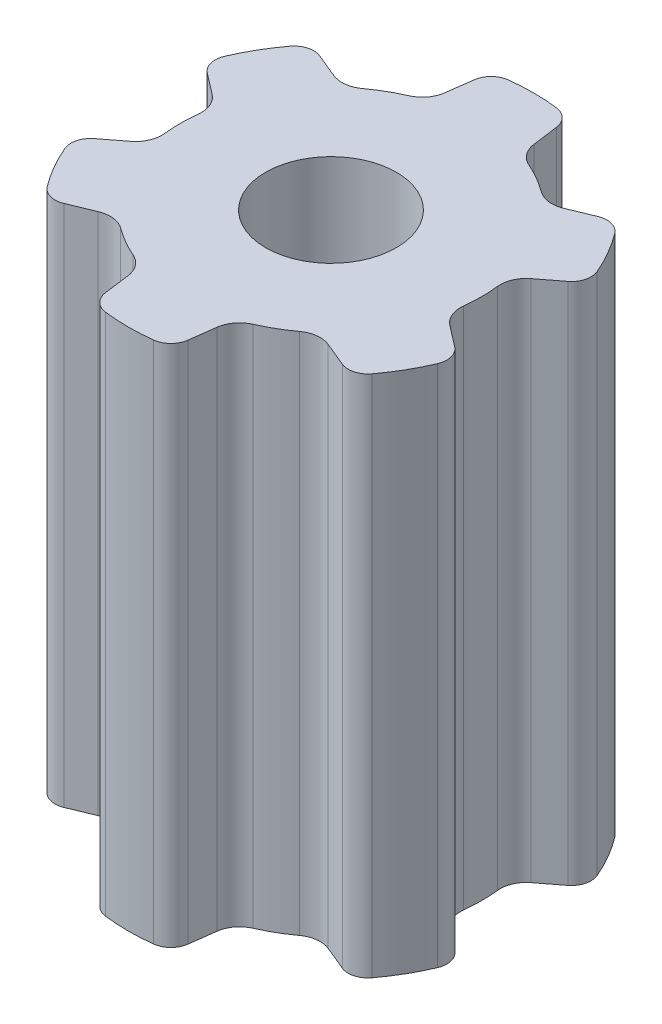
from build123d import *

# Parameters (mm, degrees)
SKETCH1_R                = 2.875
SKETCH1_R_2              = 1.25
EXTRUDE1_DEPTH           = 10
EXTRUDE2_DEPTH           = 10
FILLET1_R                = 0.5
FILLET2_R                = 0.375
CIRPATTERN1_COUNT        = 6
FILLET1_OF_CIRPATTERN1_R = 0.5
FILLET2_OF_CIRPATTERN1_R = 0.375


with BuildPart() as part:
    # Sketch1 → Extrude1 (new body)
    with BuildSketch(Plane(origin=(0, 0, 0), x_dir=(1, 0, 0), z_dir=(0, 1, 0))):
        with Locations(Location((0, 0, 0), (0, 0, 270))):
            Circle(SKETCH1_R)
        with Locations(Location((0, 0, 0), (0, 0, 270))):
            Circle(SKETCH1_R_2, mode=Mode.SUBTRACT)
    extrude(amount=EXTRUDE1_DEPTH)

    # Sketch1_3 → Extrude2 (add)
    with BuildSketch(Plane(origin=(0, 0, 0), x_dir=(1, 0, 0), z_dir=(0, 1, 0))):
        with BuildLine():
            ThreePointArc((-0.890625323, 2.733571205), (-0.450892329, 2.839422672), (0, 2.875))
            Line((0, 2.875), (0, 3.875))
            ThreePointArc((0, 3.875), (-0.376785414, 3.856638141), (-0.75, 3.801726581))
            Line((-0.75, 3.801726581), (-0.890625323, 2.733571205))
        make_face()
        with BuildLine():
            Line((0, 3.875), (0, 2.875))
            ThreePointArc((0, 2.875), (0.450892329, 2.839422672), (0.890625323, 2.733571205))
            Line((0.890625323, 2.733571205), (0.75, 3.801726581))
            ThreePointArc((0.75, 3.801726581), (0.376785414, 3.856638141), (0, 3.875))
        make_face()
    extrude2 = extrude(amount=EXTRUDE2_DEPTH)

    # Fillet1
    fillet1_edges = [part.edges().sort_by_distance(p)[0] for p in [
        (-0.890625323, 5, -2.733571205),
        (0.890625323, 5, -2.733571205),
    ]]
    fillet(fillet1_edges, radius=FILLET1_R)

    # Fillet2
    fillet2_edges = [part.edges().sort_by_distance(p)[0] for p in [
        (0.75, 5, -3.801726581),
        (-0.75, 5, -3.801726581),
    ]]
    fillet(fillet2_edges, radius=FILLET2_R)

    # CirPattern1: Extrude2 ×6 about axis
    cirpattern1_axis = Axis((0, 0, 0), (0, 1, 0))
    for i in range(1, CIRPATTERN1_COUNT):
        add(extrude2.rotate(cirpattern1_axis, i * 360 / CIRPATTERN1_COUNT))

    # Fillet1 of CirPattern1
    fillet1_of_cirpattern1_edges = [part.edges().sort_by_distance(p)[0] for p in [
        (-2.812654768, 5, -0.595481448),
        (-1.922029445, 5, -2.138089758),
        (-1.922029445, 5, 2.138089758),
        (-2.812654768, 5, 0.595481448),
        (0.890625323, 5, 2.733571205),
        (-0.890625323, 5, 2.733571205),
        (2.812654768, 5, 0.595481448),
        (1.922029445, 5, 2.138089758),
        (1.922029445, 5, -2.138089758),
        (2.812654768, 5, -0.595481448),
    ]]
    fillet(fillet1_of_cirpattern1_edges, radius=FILLET1_OF_CIRPATTERN1_R)

    # Fillet2 of CirPattern1
    fillet2_of_cirpattern1_edges = [part.edges().sort_by_distance(p)[0] for p in [
        (-2.917391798, 5, -2.550382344),
        (-3.667391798, 5, -1.251344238),
        (-3.667391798, 5, 1.251344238),
        (-2.917391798, 5, 2.550382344),
        (-0.75, 5, 3.801726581),
        (0.75, 5, 3.801726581),
        (2.917391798, 5, 2.550382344),
        (3.667391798, 5, 1.251344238),
        (3.667391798, 5, -1.251344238),
        (2.917391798, 5, -2.550382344),
    ]]
    fillet(fillet2_of_cirpattern1_edges, radius=FILLET2_OF_CIRPATTERN1_R)


solid = part.part
